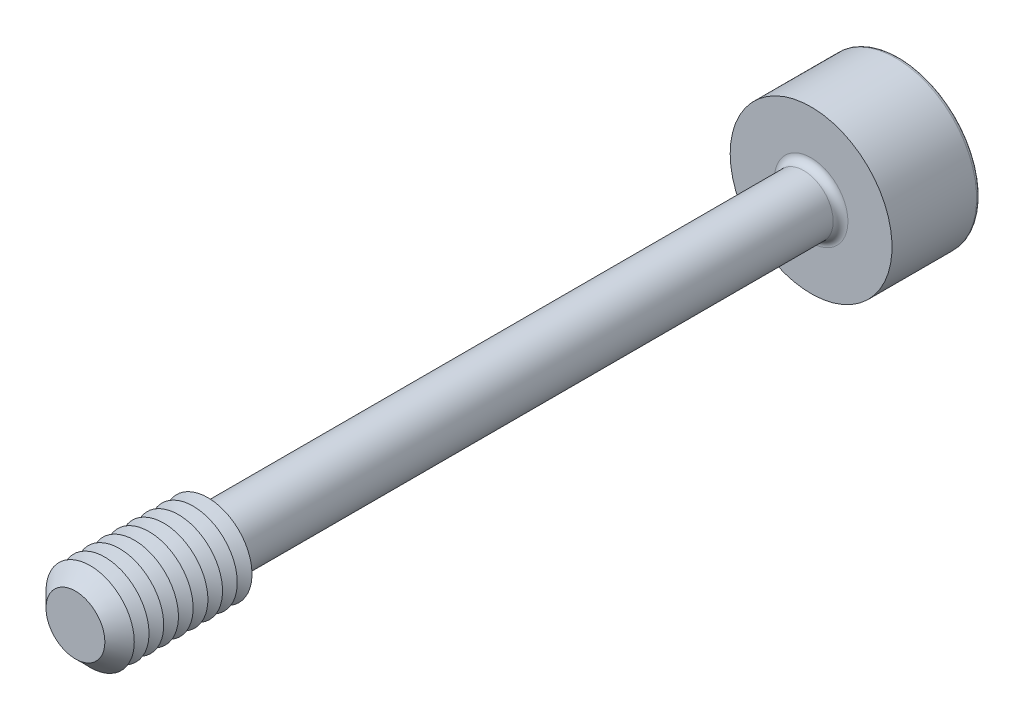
ISO-10303-21;
HEADER;
FILE_DESCRIPTION(('STEP AP214'),'2;1');
FILE_NAME('part.step','',(''),(''),'','','');
FILE_SCHEMA(('AUTOMOTIVE_DESIGN { 1 0 10303 214 1 1 1 1 }'));
ENDSEC;
DATA;
#1=APPLICATION_CONTEXT('core data for automotive mechanical design processes');
#2=APPLICATION_PROTOCOL_DEFINITION('international standard','automotive_design',2000,#1);
#3=PRODUCT_CONTEXT('',#1,'mechanical');
#4=PRODUCT('Part','Part','',(#3));
#5=PRODUCT_RELATED_PRODUCT_CATEGORY('part','',(#4));
#6=PRODUCT_DEFINITION_FORMATION('','',#4);
#7=PRODUCT_DEFINITION_CONTEXT('part definition',#1,'design');
#8=PRODUCT_DEFINITION('design','',#6,#7);
#9=PRODUCT_DEFINITION_SHAPE('','',#8);
#10=(LENGTH_UNIT() NAMED_UNIT(*) SI_UNIT(.MILLI.,.METRE.));
#11=(NAMED_UNIT(*) PLANE_ANGLE_UNIT() SI_UNIT($,.RADIAN.));
#12=(NAMED_UNIT(*) SI_UNIT($,.STERADIAN.) SOLID_ANGLE_UNIT());
#13=UNCERTAINTY_MEASURE_WITH_UNIT(LENGTH_MEASURE(1.E-05),#10,'distance_accuracy_value','');
#14=(GEOMETRIC_REPRESENTATION_CONTEXT(3) GLOBAL_UNCERTAINTY_ASSIGNED_CONTEXT((#13)) GLOBAL_UNIT_ASSIGNED_CONTEXT((#10,
#11,#12)) REPRESENTATION_CONTEXT('',''));
#15=CARTESIAN_POINT('',(0.,0.,0.));
#16=DIRECTION('',(0.,0.,1.));
#17=DIRECTION('',(1.,0.,0.));
#18=AXIS2_PLACEMENT_3D('',#15,#16,#17);
#19=CARTESIAN_POINT('',(-0.721687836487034,-1.25,-13.));
#20=DIRECTION('',(0.,0.,1.));
#21=DIRECTION('',(1.,0.,0.));
#22=AXIS2_PLACEMENT_3D('',#19,#20,#21);
#23=PLANE('',#22);
#24=DIRECTION('',(1.,0.,0.));
#25=VECTOR('',#24,1.);
#26=CARTESIAN_POINT('',(-0.721687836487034,-1.25,-13.));
#27=LINE('',#26,#25);
#28=CARTESIAN_POINT('',(0.,-1.25,-13.));
#29=VERTEX_POINT('',#28);
#30=CARTESIAN_POINT('',(0.721687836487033,-1.25,-13.));
#31=VERTEX_POINT('',#30);
#32=EDGE_CURVE('E410',#29,#31,#27,.T.);
#33=ORIENTED_EDGE('',*,*,#32,.F.);
#34=CARTESIAN_POINT('',(0.,0.,-13.));
#35=DIRECTION('',(0.,0.,1.));
#36=DIRECTION('',(0.,-1.,0.));
#37=AXIS2_PLACEMENT_3D('',#34,#35,#36);
#38=CIRCLE('',#37,1.25);
#39=CARTESIAN_POINT('',(1.08253175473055,-0.624999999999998,-13.));
#40=VERTEX_POINT('',#39);
#41=EDGE_CURVE('E53',#29,#40,#38,.T.);
#42=ORIENTED_EDGE('',*,*,#41,.T.);
#43=DIRECTION('',(0.499999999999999,0.866025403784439,0.));
#44=VECTOR('',#43,1.);
#45=CARTESIAN_POINT('',(0.721687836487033,-1.25,-13.));
#46=LINE('',#45,#44);
#47=EDGE_CURVE('E400',#31,#40,#46,.T.);
#48=ORIENTED_EDGE('',*,*,#47,.F.);
#49=EDGE_LOOP('',(#33,#42,#48));
#50=FACE_BOUND('',#49,.T.);
#51=ADVANCED_FACE('F41',(#50),#23,.F.);
#52=CARTESIAN_POINT('',(1.44337567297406,0.,-13.));
#53=VERTEX_POINT('',#52);
#54=EDGE_CURVE('E404',#40,#53,#46,.T.);
#55=ORIENTED_EDGE('',*,*,#54,.F.);
#56=CARTESIAN_POINT('',(1.08253175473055,0.625000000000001,-13.));
#57=VERTEX_POINT('',#56);
#58=EDGE_CURVE('E11',#40,#57,#38,.T.);
#59=ORIENTED_EDGE('',*,*,#58,.T.);
#60=DIRECTION('',(-0.499999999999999,0.866025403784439,0.));
#61=VECTOR('',#60,1.);
#62=CARTESIAN_POINT('',(1.44337567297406,0.,-13.));
#63=LINE('',#62,#61);
#64=EDGE_CURVE('E396',#53,#57,#63,.T.);
#65=ORIENTED_EDGE('',*,*,#64,.F.);
#66=EDGE_LOOP('',(#55,#59,#65));
#67=FACE_BOUND('',#66,.T.);
#68=ADVANCED_FACE('F133',(#67),#23,.F.);
#69=CARTESIAN_POINT('',(0.721687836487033,1.25,-13.));
#70=VERTEX_POINT('',#69);
#71=EDGE_CURVE('E395',#57,#70,#63,.T.);
#72=ORIENTED_EDGE('',*,*,#71,.F.);
#73=CARTESIAN_POINT('',(0.,1.25,-13.));
#74=VERTEX_POINT('',#73);
#75=EDGE_CURVE('E51',#57,#74,#38,.T.);
#76=ORIENTED_EDGE('',*,*,#75,.T.);
#77=DIRECTION('',(-1.,0.,0.));
#78=VECTOR('',#77,1.);
#79=CARTESIAN_POINT('',(0.721687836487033,1.25,-13.));
#80=LINE('',#79,#78);
#81=EDGE_CURVE('E177',#70,#74,#80,.T.);
#82=ORIENTED_EDGE('',*,*,#81,.F.);
#83=EDGE_LOOP('',(#72,#76,#82));
#84=FACE_BOUND('',#83,.T.);
#85=ADVANCED_FACE('F139',(#84),#23,.F.);
#86=CARTESIAN_POINT('',(-0.721687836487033,1.25,-13.));
#87=VERTEX_POINT('',#86);
#88=EDGE_CURVE('E401',#74,#87,#80,.T.);
#89=ORIENTED_EDGE('',*,*,#88,.F.);
#90=CARTESIAN_POINT('',(-1.08253175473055,0.625000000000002,-13.));
#91=VERTEX_POINT('',#90);
#92=EDGE_CURVE('E265',#74,#91,#38,.T.);
#93=ORIENTED_EDGE('',*,*,#92,.T.);
#94=DIRECTION('',(-0.5,-0.866025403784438,0.));
#95=VECTOR('',#94,1.);
#96=CARTESIAN_POINT('',(-0.721687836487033,1.25,-13.));
#97=LINE('',#96,#95);
#98=EDGE_CURVE('E176',#87,#91,#97,.T.);
#99=ORIENTED_EDGE('',*,*,#98,.F.);
#100=EDGE_LOOP('',(#89,#93,#99));
#101=FACE_BOUND('',#100,.T.);
#102=ADVANCED_FACE('F157',(#101),#23,.F.);
#103=CARTESIAN_POINT('',(-1.44337567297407,0.,-13.));
#104=VERTEX_POINT('',#103);
#105=EDGE_CURVE('E170',#91,#104,#97,.T.);
#106=ORIENTED_EDGE('',*,*,#105,.F.);
#107=CARTESIAN_POINT('',(-1.08253175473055,-0.624999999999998,-13.));
#108=VERTEX_POINT('',#107);
#109=EDGE_CURVE('E172',#91,#108,#38,.T.);
#110=ORIENTED_EDGE('',*,*,#109,.T.);
#111=DIRECTION('',(0.5,-0.866025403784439,0.));
#112=VECTOR('',#111,1.);
#113=CARTESIAN_POINT('',(-1.44337567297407,0.,-13.));
#114=LINE('',#113,#112);
#115=EDGE_CURVE('E174',#104,#108,#114,.T.);
#116=ORIENTED_EDGE('',*,*,#115,.F.);
#117=EDGE_LOOP('',(#106,#110,#116));
#118=FACE_BOUND('',#117,.T.);
#119=ADVANCED_FACE('F146',(#118),#23,.F.);
#120=CARTESIAN_POINT('',(0.,0.,-15.5));
#121=DIRECTION('',(0.,0.,-1.));
#122=DIRECTION('',(-1.,0.,0.));
#123=AXIS2_PLACEMENT_3D('',#120,#121,#122);
#124=PLANE('',#123);
#125=CARTESIAN_POINT('',(0.,0.,-15.5));
#126=DIRECTION('',(0.,0.,-1.));
#127=DIRECTION('',(-1.,0.,0.));
#128=AXIS2_PLACEMENT_3D('',#125,#126,#127);
#129=CIRCLE('',#128,2.625);
#130=CARTESIAN_POINT('',(-2.625,0.,-15.5));
#131=VERTEX_POINT('',#130);
#132=EDGE_CURVE('E249',#131,#131,#129,.T.);
#133=ORIENTED_EDGE('',*,*,#132,.T.);
#134=EDGE_LOOP('',(#133));
#135=FACE_BOUND('',#134,.T.);
#136=DIRECTION('',(-0.5,-0.866025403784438,0.));
#137=VECTOR('',#136,1.);
#138=CARTESIAN_POINT('',(-0.721687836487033,1.25,-15.5));
#139=LINE('',#138,#137);
#140=CARTESIAN_POINT('',(-0.721687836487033,1.25,-15.5));
#141=VERTEX_POINT('',#140);
#142=CARTESIAN_POINT('',(-1.44337567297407,0.,-15.5));
#143=VERTEX_POINT('',#142);
#144=EDGE_CURVE('E212',#141,#143,#139,.T.);
#145=ORIENTED_EDGE('',*,*,#144,.T.);
#146=DIRECTION('',(0.5,-0.866025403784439,0.));
#147=VECTOR('',#146,1.);
#148=CARTESIAN_POINT('',(-1.44337567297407,0.,-15.5));
#149=LINE('',#148,#147);
#150=CARTESIAN_POINT('',(-0.721687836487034,-1.25,-15.5));
#151=VERTEX_POINT('',#150);
#152=EDGE_CURVE('E67',#143,#151,#149,.T.);
#153=ORIENTED_EDGE('',*,*,#152,.T.);
#154=DIRECTION('',(1.,0.,0.));
#155=VECTOR('',#154,1.);
#156=CARTESIAN_POINT('',(-0.721687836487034,-1.25,-15.5));
#157=LINE('',#156,#155);
#158=CARTESIAN_POINT('',(0.721687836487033,-1.25,-15.5));
#159=VERTEX_POINT('',#158);
#160=EDGE_CURVE('E196',#151,#159,#157,.T.);
#161=ORIENTED_EDGE('',*,*,#160,.T.);
#162=DIRECTION('',(0.499999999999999,0.866025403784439,0.));
#163=VECTOR('',#162,1.);
#164=CARTESIAN_POINT('',(0.721687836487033,-1.25,-15.5));
#165=LINE('',#164,#163);
#166=CARTESIAN_POINT('',(1.44337567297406,0.,-15.5));
#167=VERTEX_POINT('',#166);
#168=EDGE_CURVE('E200',#159,#167,#165,.T.);
#169=ORIENTED_EDGE('',*,*,#168,.T.);
#170=DIRECTION('',(-0.499999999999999,0.866025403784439,0.));
#171=VECTOR('',#170,1.);
#172=CARTESIAN_POINT('',(1.44337567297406,0.,-15.5));
#173=LINE('',#172,#171);
#174=CARTESIAN_POINT('',(0.721687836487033,1.25,-15.5));
#175=VERTEX_POINT('',#174);
#176=EDGE_CURVE('E204',#167,#175,#173,.T.);
#177=ORIENTED_EDGE('',*,*,#176,.T.);
#178=DIRECTION('',(-1.,0.,0.));
#179=VECTOR('',#178,1.);
#180=CARTESIAN_POINT('',(0.721687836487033,1.25,-15.5));
#181=LINE('',#180,#179);
#182=EDGE_CURVE('E208',#175,#141,#181,.T.);
#183=ORIENTED_EDGE('',*,*,#182,.T.);
#184=EDGE_LOOP('',(#145,#153,#161,#169,#177,#183));
#185=FACE_BOUND('',#184,.T.);
#186=ADVANCED_FACE('F156',(#135,#185),#124,.T.);
#187=CARTESIAN_POINT('',(0.,0.,12.5));
#188=DIRECTION('',(0.,0.,-1.));
#189=DIRECTION('',(-1.,0.,0.));
#190=AXIS2_PLACEMENT_3D('',#187,#188,#189);
#191=CYLINDRICAL_SURFACE('',#190,1.);
#192=CARTESIAN_POINT('',(0.,0.,-12.25));
#193=DIRECTION('',(0.,0.,-1.));
#194=DIRECTION('',(-1.,0.,0.));
#195=AXIS2_PLACEMENT_3D('',#192,#193,#194);
#196=CIRCLE('',#195,1.);
#197=CARTESIAN_POINT('',(-1.,0.,-12.25));
#198=VERTEX_POINT('',#197);
#199=EDGE_CURVE('E246',#198,#198,#196,.F.);
#200=ORIENTED_EDGE('',*,*,#199,.T.);
#201=EDGE_LOOP('',(#200));
#202=FACE_BOUND('',#201,.T.);
#203=CARTESIAN_POINT('',(0.,0.,7.71132486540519));
#204=DIRECTION('',(0.,0.,-1.));
#205=DIRECTION('',(0.,1.,0.));
#206=AXIS2_PLACEMENT_3D('',#203,#204,#205);
#207=CIRCLE('',#206,1.);
#208=CARTESIAN_POINT('',(0.,1.,7.71132486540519));
#209=VERTEX_POINT('',#208);
#210=EDGE_CURVE('E234',#209,#209,#207,.T.);
#211=ORIENTED_EDGE('',*,*,#210,.T.);
#212=EDGE_LOOP('',(#211));
#213=FACE_BOUND('',#212,.T.);
#214=ADVANCED_FACE('F163',(#202,#213),#191,.T.);
#215=CARTESIAN_POINT('',(0.,0.,7.71132486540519));
#216=DIRECTION('',(0.,0.,1.));
#217=DIRECTION('',(0.,-1.,0.));
#218=AXIS2_PLACEMENT_3D('',#215,#216,#217);
#219=CONICAL_SURFACE('',#218,1.,1.0471975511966);
#220=CARTESIAN_POINT('',(0.,0.,8.));
#221=DIRECTION('',(0.,0.,-1.));
#222=DIRECTION('',(-1.,0.,0.));
#223=AXIS2_PLACEMENT_3D('',#220,#221,#222);
#224=CIRCLE('',#223,1.5);
#225=CARTESIAN_POINT('',(-1.5,0.,8.));
#226=VERTEX_POINT('',#225);
#227=EDGE_CURVE('E269',#226,#226,#224,.T.);
#228=ORIENTED_EDGE('',*,*,#227,.T.);
#229=EDGE_LOOP('',(#228));
#230=FACE_BOUND('',#229,.T.);
#231=ORIENTED_EDGE('',*,*,#210,.F.);
#232=EDGE_LOOP('',(#231));
#233=FACE_BOUND('',#232,.T.);
#234=ADVANCED_FACE('F353',(#230,#233),#219,.T.);
#235=CARTESIAN_POINT('',(0.,0.,-12.5));
#236=DIRECTION('',(0.,0.,-1.));
#237=DIRECTION('',(-1.,0.,0.));
#238=AXIS2_PLACEMENT_3D('',#235,#236,#237);
#239=PLANE('',#238);
#240=CARTESIAN_POINT('',(0.,0.,-12.5));
#241=DIRECTION('',(0.,0.,-1.));
#242=DIRECTION('',(-1.,0.,0.));
#243=AXIS2_PLACEMENT_3D('',#240,#241,#242);
#244=CIRCLE('',#243,1.25);
#245=CARTESIAN_POINT('',(-1.25,0.,-12.5));
#246=VERTEX_POINT('',#245);
#247=EDGE_CURVE('E242',#246,#246,#244,.T.);
#248=ORIENTED_EDGE('',*,*,#247,.T.);
#249=EDGE_LOOP('',(#248));
#250=FACE_BOUND('',#249,.T.);
#251=CARTESIAN_POINT('',(0.,0.,-12.5));
#252=DIRECTION('',(0.,0.,-1.));
#253=DIRECTION('',(-1.,0.,0.));
#254=AXIS2_PLACEMENT_3D('',#251,#252,#253);
#255=CIRCLE('',#254,2.75);
#256=CARTESIAN_POINT('',(-2.75,0.,-12.5));
#257=VERTEX_POINT('',#256);
#258=EDGE_CURVE('E230',#257,#257,#255,.T.);
#259=ORIENTED_EDGE('',*,*,#258,.F.);
#260=EDGE_LOOP('',(#259));
#261=FACE_BOUND('',#260,.T.);
#262=ADVANCED_FACE('F358',(#250,#261),#239,.F.);
#263=CARTESIAN_POINT('',(0.,0.,-15.5));
#264=DIRECTION('',(0.,0.,1.));
#265=DIRECTION('',(1.,0.,0.));
#266=AXIS2_PLACEMENT_3D('',#263,#264,#265);
#267=CYLINDRICAL_SURFACE('',#266,2.75);
#268=CARTESIAN_POINT('',(0.,0.,-15.375));
#269=DIRECTION('',(0.,0.,-1.));
#270=DIRECTION('',(-1.,0.,0.));
#271=AXIS2_PLACEMENT_3D('',#268,#269,#270);
#272=CIRCLE('',#271,2.75);
#273=CARTESIAN_POINT('',(-2.75,0.,-15.375));
#274=VERTEX_POINT('',#273);
#275=EDGE_CURVE('E45',#274,#274,#272,.F.);
#276=ORIENTED_EDGE('',*,*,#275,.T.);
#277=EDGE_LOOP('',(#276));
#278=FACE_BOUND('',#277,.T.);
#279=ORIENTED_EDGE('',*,*,#258,.T.);
#280=EDGE_LOOP('',(#279));
#281=FACE_BOUND('',#280,.T.);
#282=ADVANCED_FACE('F359',(#278,#281),#267,.T.);
#283=CARTESIAN_POINT('',(-1.44337567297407,0.,-13.));
#284=DIRECTION('',(0.866025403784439,0.5,0.));
#285=DIRECTION('',(-0.5,0.866025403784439,0.));
#286=AXIS2_PLACEMENT_3D('',#283,#284,#285);
#287=PLANE('',#286);
#288=ORIENTED_EDGE('',*,*,#152,.F.);
#289=DIRECTION('',(0.,0.,-1.));
#290=VECTOR('',#289,1.);
#291=CARTESIAN_POINT('',(-1.44337567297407,0.,-13.));
#292=LINE('',#291,#290);
#293=EDGE_CURVE('E186',#104,#143,#292,.T.);
#294=ORIENTED_EDGE('',*,*,#293,.F.);
#295=ORIENTED_EDGE('',*,*,#115,.T.);
#296=CARTESIAN_POINT('',(-0.721687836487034,-1.25,-13.));
#297=VERTEX_POINT('',#296);
#298=EDGE_CURVE('E215',#108,#297,#114,.T.);
#299=ORIENTED_EDGE('',*,*,#298,.T.);
#300=DIRECTION('',(0.,0.,-1.));
#301=VECTOR('',#300,1.);
#302=CARTESIAN_POINT('',(-0.721687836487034,-1.25,-13.));
#303=LINE('',#302,#301);
#304=EDGE_CURVE('E227',#297,#151,#303,.T.);
#305=ORIENTED_EDGE('',*,*,#304,.T.);
#306=EDGE_LOOP('',(#288,#294,#295,#299,#305));
#307=FACE_BOUND('',#306,.T.);
#308=ADVANCED_FACE('F362',(#307),#287,.T.);
#309=CARTESIAN_POINT('',(-0.721687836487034,-1.25,-13.));
#310=DIRECTION('',(0.,1.,0.));
#311=DIRECTION('',(0.,0.,1.));
#312=AXIS2_PLACEMENT_3D('',#309,#310,#311);
#313=PLANE('',#312);
#314=ORIENTED_EDGE('',*,*,#160,.F.);
#315=ORIENTED_EDGE('',*,*,#304,.F.);
#316=EDGE_CURVE('E407',#297,#29,#27,.T.);
#317=ORIENTED_EDGE('',*,*,#316,.T.);
#318=ORIENTED_EDGE('',*,*,#32,.T.);
#319=DIRECTION('',(0.,0.,-1.));
#320=VECTOR('',#319,1.);
#321=CARTESIAN_POINT('',(0.721687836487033,-1.25,-13.));
#322=LINE('',#321,#320);
#323=EDGE_CURVE('E224',#31,#159,#322,.T.);
#324=ORIENTED_EDGE('',*,*,#323,.T.);
#325=EDGE_LOOP('',(#314,#315,#317,#318,#324));
#326=FACE_BOUND('',#325,.T.);
#327=ADVANCED_FACE('F368',(#326),#313,.T.);
#328=CARTESIAN_POINT('',(0.721687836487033,-1.25,-13.));
#329=DIRECTION('',(-0.866025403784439,0.499999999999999,0.));
#330=DIRECTION('',(-0.499999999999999,-0.866025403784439,0.));
#331=AXIS2_PLACEMENT_3D('',#328,#329,#330);
#332=PLANE('',#331);
#333=ORIENTED_EDGE('',*,*,#168,.F.);
#334=ORIENTED_EDGE('',*,*,#323,.F.);
#335=ORIENTED_EDGE('',*,*,#47,.T.);
#336=ORIENTED_EDGE('',*,*,#54,.T.);
#337=DIRECTION('',(0.,0.,-1.));
#338=VECTOR('',#337,1.);
#339=CARTESIAN_POINT('',(1.44337567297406,0.,-13.));
#340=LINE('',#339,#338);
#341=EDGE_CURVE('E221',#53,#167,#340,.T.);
#342=ORIENTED_EDGE('',*,*,#341,.T.);
#343=EDGE_LOOP('',(#333,#334,#335,#336,#342));
#344=FACE_BOUND('',#343,.T.);
#345=ADVANCED_FACE('F371',(#344),#332,.T.);
#346=CARTESIAN_POINT('',(1.44337567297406,0.,-13.));
#347=DIRECTION('',(-0.866025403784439,-0.5,0.));
#348=DIRECTION('',(0.5,-0.866025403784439,0.));
#349=AXIS2_PLACEMENT_3D('',#346,#347,#348);
#350=PLANE('',#349);
#351=ORIENTED_EDGE('',*,*,#176,.F.);
#352=ORIENTED_EDGE('',*,*,#341,.F.);
#353=ORIENTED_EDGE('',*,*,#64,.T.);
#354=ORIENTED_EDGE('',*,*,#71,.T.);
#355=DIRECTION('',(0.,0.,-1.));
#356=VECTOR('',#355,1.);
#357=CARTESIAN_POINT('',(0.721687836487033,1.25,-13.));
#358=LINE('',#357,#356);
#359=EDGE_CURVE('E219',#70,#175,#358,.T.);
#360=ORIENTED_EDGE('',*,*,#359,.T.);
#361=EDGE_LOOP('',(#351,#352,#353,#354,#360));
#362=FACE_BOUND('',#361,.T.);
#363=ADVANCED_FACE('F375',(#362),#350,.T.);
#364=CARTESIAN_POINT('',(0.721687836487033,1.25,-13.));
#365=DIRECTION('',(0.,-1.,0.));
#366=DIRECTION('',(1.,0.,0.));
#367=AXIS2_PLACEMENT_3D('',#364,#365,#366);
#368=PLANE('',#367);
#369=ORIENTED_EDGE('',*,*,#182,.F.);
#370=ORIENTED_EDGE('',*,*,#359,.F.);
#371=ORIENTED_EDGE('',*,*,#81,.T.);
#372=ORIENTED_EDGE('',*,*,#88,.T.);
#373=DIRECTION('',(0.,0.,-1.));
#374=VECTOR('',#373,1.);
#375=CARTESIAN_POINT('',(-0.721687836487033,1.25,-13.));
#376=LINE('',#375,#374);
#377=EDGE_CURVE('E182',#87,#141,#376,.T.);
#378=ORIENTED_EDGE('',*,*,#377,.T.);
#379=EDGE_LOOP('',(#369,#370,#371,#372,#378));
#380=FACE_BOUND('',#379,.T.);
#381=ADVANCED_FACE('F152',(#380),#368,.T.);
#382=CARTESIAN_POINT('',(-0.721687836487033,1.25,-13.));
#383=DIRECTION('',(0.866025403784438,-0.5,0.));
#384=DIRECTION('',(0.5,0.866025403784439,0.));
#385=AXIS2_PLACEMENT_3D('',#382,#383,#384);
#386=PLANE('',#385);
#387=ORIENTED_EDGE('',*,*,#144,.F.);
#388=ORIENTED_EDGE('',*,*,#377,.F.);
#389=ORIENTED_EDGE('',*,*,#98,.T.);
#390=ORIENTED_EDGE('',*,*,#105,.T.);
#391=ORIENTED_EDGE('',*,*,#293,.T.);
#392=EDGE_LOOP('',(#387,#388,#389,#390,#391));
#393=FACE_BOUND('',#392,.T.);
#394=ADVANCED_FACE('F144',(#393),#386,.T.);
#395=ORIENTED_EDGE('',*,*,#298,.F.);
#396=EDGE_CURVE('E256',#108,#29,#38,.T.);
#397=ORIENTED_EDGE('',*,*,#396,.T.);
#398=ORIENTED_EDGE('',*,*,#316,.F.);
#399=EDGE_LOOP('',(#395,#397,#398));
#400=FACE_BOUND('',#399,.T.);
#401=ADVANCED_FACE('F135',(#400),#23,.F.);
#402=CARTESIAN_POINT('',(0.,0.,-12.25));
#403=DIRECTION('',(0.,0.,-1.));
#404=DIRECTION('',(-1.,0.,0.));
#405=AXIS2_PLACEMENT_3D('',#402,#403,#404);
#406=TOROIDAL_SURFACE('',#405,1.25,0.25);
#407=ORIENTED_EDGE('',*,*,#199,.F.);
#408=EDGE_LOOP('',(#407));
#409=FACE_BOUND('',#408,.T.);
#410=ORIENTED_EDGE('',*,*,#247,.F.);
#411=EDGE_LOOP('',(#410));
#412=FACE_BOUND('',#411,.T.);
#413=ADVANCED_FACE('F129',(#409,#412),#406,.F.);
#414=CARTESIAN_POINT('',(0.,0.,-15.375));
#415=DIRECTION('',(0.,0.,-1.));
#416=DIRECTION('',(-1.,0.,0.));
#417=AXIS2_PLACEMENT_3D('',#414,#415,#416);
#418=TOROIDAL_SURFACE('',#417,2.625,0.125);
#419=ORIENTED_EDGE('',*,*,#275,.F.);
#420=EDGE_LOOP('',(#419));
#421=FACE_BOUND('',#420,.T.);
#422=ORIENTED_EDGE('',*,*,#132,.F.);
#423=EDGE_LOOP('',(#422));
#424=FACE_BOUND('',#423,.T.);
#425=ADVANCED_FACE('F43',(#421,#424),#418,.T.);
#426=CARTESIAN_POINT('',(0.,0.,-12.278312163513));
#427=DIRECTION('',(0.,0.,-1.));
#428=DIRECTION('',(0.,1.,0.));
#429=AXIS2_PLACEMENT_3D('',#426,#427,#428);
#430=CONICAL_SURFACE('',#429,0.,1.0471975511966);
#431=ORIENTED_EDGE('',*,*,#41,.F.);
#432=ORIENTED_EDGE('',*,*,#396,.F.);
#433=ORIENTED_EDGE('',*,*,#109,.F.);
#434=ORIENTED_EDGE('',*,*,#92,.F.);
#435=ORIENTED_EDGE('',*,*,#75,.F.);
#436=ORIENTED_EDGE('',*,*,#58,.F.);
#437=EDGE_LOOP('',(#431,#432,#433,#434,#435,#436));
#438=FACE_BOUND('',#437,.T.);
#439=CARTESIAN_POINT('',(0.,0.,-12.278312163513));
#440=VERTEX_POINT('',#439);
#441=VERTEX_LOOP('',#440);
#442=FACE_BOUND('',#441,.T.);
#443=ADVANCED_FACE('F118',(#438,#442),#430,.F.);
#444=CARTESIAN_POINT('',(0.,0.,8.25));
#445=DIRECTION('',(0.,0.,-1.));
#446=DIRECTION('',(-1.,0.,0.));
#447=AXIS2_PLACEMENT_3D('',#444,#445,#446);
#448=CONICAL_SURFACE('',#447,1.06698729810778,1.0471975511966);
#449=ORIENTED_EDGE('',*,*,#227,.F.);
#450=EDGE_LOOP('',(#449));
#451=FACE_BOUND('',#450,.T.);
#452=CARTESIAN_POINT('',(0.,0.,8.25));
#453=DIRECTION('',(0.,0.,-1.));
#454=DIRECTION('',(-1.,0.,0.));
#455=AXIS2_PLACEMENT_3D('',#452,#453,#454);
#456=CIRCLE('',#455,1.06698729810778);
#457=CARTESIAN_POINT('',(-1.06698729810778,0.,8.25));
#458=VERTEX_POINT('',#457);
#459=EDGE_CURVE('E275',#458,#458,#456,.T.);
#460=ORIENTED_EDGE('',*,*,#459,.T.);
#461=EDGE_LOOP('',(#460));
#462=FACE_BOUND('',#461,.T.);
#463=ADVANCED_FACE('F120',(#451,#462),#448,.T.);
#464=CARTESIAN_POINT('',(0.,0.,8.5));
#465=DIRECTION('',(0.,0.,1.));
#466=DIRECTION('',(1.,0.,0.));
#467=AXIS2_PLACEMENT_3D('',#464,#465,#466);
#468=CONICAL_SURFACE('',#467,1.5,1.0471975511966);
#469=ORIENTED_EDGE('',*,*,#459,.F.);
#470=EDGE_LOOP('',(#469));
#471=FACE_BOUND('',#470,.T.);
#472=CARTESIAN_POINT('',(0.,0.,8.5));
#473=DIRECTION('',(0.,0.,-1.));
#474=DIRECTION('',(-1.,0.,0.));
#475=AXIS2_PLACEMENT_3D('',#472,#473,#474);
#476=CIRCLE('',#475,1.5);
#477=CARTESIAN_POINT('',(-1.5,0.,8.5));
#478=VERTEX_POINT('',#477);
#479=EDGE_CURVE('E280',#478,#478,#476,.T.);
#480=ORIENTED_EDGE('',*,*,#479,.T.);
#481=EDGE_LOOP('',(#480));
#482=FACE_BOUND('',#481,.T.);
#483=ADVANCED_FACE('F126',(#471,#482),#468,.T.);
#484=CARTESIAN_POINT('',(0.,0.,8.75));
#485=DIRECTION('',(0.,0.,-1.));
#486=DIRECTION('',(-1.,0.,0.));
#487=AXIS2_PLACEMENT_3D('',#484,#485,#486);
#488=CONICAL_SURFACE('',#487,1.06698729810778,1.0471975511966);
#489=ORIENTED_EDGE('',*,*,#479,.F.);
#490=EDGE_LOOP('',(#489));
#491=FACE_BOUND('',#490,.T.);
#492=CARTESIAN_POINT('',(0.,0.,8.75));
#493=DIRECTION('',(0.,0.,-1.));
#494=DIRECTION('',(-1.,0.,0.));
#495=AXIS2_PLACEMENT_3D('',#492,#493,#494);
#496=CIRCLE('',#495,1.06698729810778);
#497=CARTESIAN_POINT('',(-1.06698729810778,0.,8.75));
#498=VERTEX_POINT('',#497);
#499=EDGE_CURVE('E286',#498,#498,#496,.T.);
#500=ORIENTED_EDGE('',*,*,#499,.T.);
#501=EDGE_LOOP('',(#500));
#502=FACE_BOUND('',#501,.T.);
#503=ADVANCED_FACE('F516',(#491,#502),#488,.T.);
#504=CARTESIAN_POINT('',(0.,0.,9.));
#505=DIRECTION('',(0.,0.,1.));
#506=DIRECTION('',(1.,0.,0.));
#507=AXIS2_PLACEMENT_3D('',#504,#505,#506);
#508=CONICAL_SURFACE('',#507,1.5,1.0471975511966);
#509=ORIENTED_EDGE('',*,*,#499,.F.);
#510=EDGE_LOOP('',(#509));
#511=FACE_BOUND('',#510,.T.);
#512=CARTESIAN_POINT('',(0.,0.,9.));
#513=DIRECTION('',(0.,0.,-1.));
#514=DIRECTION('',(-1.,0.,0.));
#515=AXIS2_PLACEMENT_3D('',#512,#513,#514);
#516=CIRCLE('',#515,1.5);
#517=CARTESIAN_POINT('',(-1.5,0.,9.));
#518=VERTEX_POINT('',#517);
#519=EDGE_CURVE('E289',#518,#518,#516,.T.);
#520=ORIENTED_EDGE('',*,*,#519,.T.);
#521=EDGE_LOOP('',(#520));
#522=FACE_BOUND('',#521,.T.);
#523=ADVANCED_FACE('F525',(#511,#522),#508,.T.);
#524=CARTESIAN_POINT('',(0.,0.,9.25));
#525=DIRECTION('',(0.,0.,-1.));
#526=DIRECTION('',(-1.,0.,0.));
#527=AXIS2_PLACEMENT_3D('',#524,#525,#526);
#528=CONICAL_SURFACE('',#527,1.06698729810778,1.0471975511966);
#529=ORIENTED_EDGE('',*,*,#519,.F.);
#530=EDGE_LOOP('',(#529));
#531=FACE_BOUND('',#530,.T.);
#532=CARTESIAN_POINT('',(0.,0.,9.25));
#533=DIRECTION('',(0.,0.,-1.));
#534=DIRECTION('',(-1.,0.,0.));
#535=AXIS2_PLACEMENT_3D('',#532,#533,#534);
#536=CIRCLE('',#535,1.06698729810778);
#537=CARTESIAN_POINT('',(-1.06698729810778,0.,9.25));
#538=VERTEX_POINT('',#537);
#539=EDGE_CURVE('E293',#538,#538,#536,.T.);
#540=ORIENTED_EDGE('',*,*,#539,.T.);
#541=EDGE_LOOP('',(#540));
#542=FACE_BOUND('',#541,.T.);
#543=ADVANCED_FACE('F534',(#531,#542),#528,.T.);
#544=CARTESIAN_POINT('',(0.,0.,9.5));
#545=DIRECTION('',(0.,0.,1.));
#546=DIRECTION('',(1.,0.,0.));
#547=AXIS2_PLACEMENT_3D('',#544,#545,#546);
#548=CONICAL_SURFACE('',#547,1.5,1.0471975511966);
#549=ORIENTED_EDGE('',*,*,#539,.F.);
#550=EDGE_LOOP('',(#549));
#551=FACE_BOUND('',#550,.T.);
#552=CARTESIAN_POINT('',(0.,0.,9.5));
#553=DIRECTION('',(0.,0.,-1.));
#554=DIRECTION('',(-1.,0.,0.));
#555=AXIS2_PLACEMENT_3D('',#552,#553,#554);
#556=CIRCLE('',#555,1.5);
#557=CARTESIAN_POINT('',(-1.5,0.,9.5));
#558=VERTEX_POINT('',#557);
#559=EDGE_CURVE('E297',#558,#558,#556,.T.);
#560=ORIENTED_EDGE('',*,*,#559,.T.);
#561=EDGE_LOOP('',(#560));
#562=FACE_BOUND('',#561,.T.);
#563=ADVANCED_FACE('F543',(#551,#562),#548,.T.);
#564=CARTESIAN_POINT('',(0.,0.,9.75));
#565=DIRECTION('',(0.,0.,-1.));
#566=DIRECTION('',(-1.,0.,0.));
#567=AXIS2_PLACEMENT_3D('',#564,#565,#566);
#568=CONICAL_SURFACE('',#567,1.06698729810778,1.0471975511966);
#569=ORIENTED_EDGE('',*,*,#559,.F.);
#570=EDGE_LOOP('',(#569));
#571=FACE_BOUND('',#570,.T.);
#572=CARTESIAN_POINT('',(0.,0.,9.75));
#573=DIRECTION('',(0.,0.,-1.));
#574=DIRECTION('',(-1.,0.,0.));
#575=AXIS2_PLACEMENT_3D('',#572,#573,#574);
#576=CIRCLE('',#575,1.06698729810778);
#577=CARTESIAN_POINT('',(-1.06698729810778,0.,9.75));
#578=VERTEX_POINT('',#577);
#579=EDGE_CURVE('E301',#578,#578,#576,.T.);
#580=ORIENTED_EDGE('',*,*,#579,.T.);
#581=EDGE_LOOP('',(#580));
#582=FACE_BOUND('',#581,.T.);
#583=ADVANCED_FACE('F552',(#571,#582),#568,.T.);
#584=CARTESIAN_POINT('',(0.,0.,10.));
#585=DIRECTION('',(0.,0.,1.));
#586=DIRECTION('',(1.,0.,0.));
#587=AXIS2_PLACEMENT_3D('',#584,#585,#586);
#588=CONICAL_SURFACE('',#587,1.5,1.0471975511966);
#589=ORIENTED_EDGE('',*,*,#579,.F.);
#590=EDGE_LOOP('',(#589));
#591=FACE_BOUND('',#590,.T.);
#592=CARTESIAN_POINT('',(0.,0.,10.));
#593=DIRECTION('',(0.,0.,-1.));
#594=DIRECTION('',(-1.,0.,0.));
#595=AXIS2_PLACEMENT_3D('',#592,#593,#594);
#596=CIRCLE('',#595,1.5);
#597=CARTESIAN_POINT('',(-1.5,0.,10.));
#598=VERTEX_POINT('',#597);
#599=EDGE_CURVE('E305',#598,#598,#596,.T.);
#600=ORIENTED_EDGE('',*,*,#599,.T.);
#601=EDGE_LOOP('',(#600));
#602=FACE_BOUND('',#601,.T.);
#603=ADVANCED_FACE('F561',(#591,#602),#588,.T.);
#604=CARTESIAN_POINT('',(0.,0.,10.25));
#605=DIRECTION('',(0.,0.,-1.));
#606=DIRECTION('',(-1.,0.,0.));
#607=AXIS2_PLACEMENT_3D('',#604,#605,#606);
#608=CONICAL_SURFACE('',#607,1.06698729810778,1.0471975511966);
#609=ORIENTED_EDGE('',*,*,#599,.F.);
#610=EDGE_LOOP('',(#609));
#611=FACE_BOUND('',#610,.T.);
#612=CARTESIAN_POINT('',(0.,0.,10.25));
#613=DIRECTION('',(0.,0.,-1.));
#614=DIRECTION('',(-1.,0.,0.));
#615=AXIS2_PLACEMENT_3D('',#612,#613,#614);
#616=CIRCLE('',#615,1.06698729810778);
#617=CARTESIAN_POINT('',(-1.06698729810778,0.,10.25));
#618=VERTEX_POINT('',#617);
#619=EDGE_CURVE('E308',#618,#618,#616,.T.);
#620=ORIENTED_EDGE('',*,*,#619,.T.);
#621=EDGE_LOOP('',(#620));
#622=FACE_BOUND('',#621,.T.);
#623=ADVANCED_FACE('F570',(#611,#622),#608,.T.);
#624=CARTESIAN_POINT('',(0.,0.,10.5));
#625=DIRECTION('',(0.,0.,1.));
#626=DIRECTION('',(1.,0.,0.));
#627=AXIS2_PLACEMENT_3D('',#624,#625,#626);
#628=CONICAL_SURFACE('',#627,1.5,1.0471975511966);
#629=ORIENTED_EDGE('',*,*,#619,.F.);
#630=EDGE_LOOP('',(#629));
#631=FACE_BOUND('',#630,.T.);
#632=CARTESIAN_POINT('',(0.,0.,10.5));
#633=DIRECTION('',(0.,0.,-1.));
#634=DIRECTION('',(-1.,0.,0.));
#635=AXIS2_PLACEMENT_3D('',#632,#633,#634);
#636=CIRCLE('',#635,1.5);
#637=CARTESIAN_POINT('',(-1.5,0.,10.5));
#638=VERTEX_POINT('',#637);
#639=EDGE_CURVE('E311',#638,#638,#636,.T.);
#640=ORIENTED_EDGE('',*,*,#639,.T.);
#641=EDGE_LOOP('',(#640));
#642=FACE_BOUND('',#641,.T.);
#643=ADVANCED_FACE('F579',(#631,#642),#628,.T.);
#644=CARTESIAN_POINT('',(0.,0.,10.75));
#645=DIRECTION('',(0.,0.,-1.));
#646=DIRECTION('',(-1.,0.,0.));
#647=AXIS2_PLACEMENT_3D('',#644,#645,#646);
#648=CONICAL_SURFACE('',#647,1.06698729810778,1.0471975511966);
#649=ORIENTED_EDGE('',*,*,#639,.F.);
#650=EDGE_LOOP('',(#649));
#651=FACE_BOUND('',#650,.T.);
#652=CARTESIAN_POINT('',(0.,0.,10.75));
#653=DIRECTION('',(0.,0.,-1.));
#654=DIRECTION('',(-1.,0.,0.));
#655=AXIS2_PLACEMENT_3D('',#652,#653,#654);
#656=CIRCLE('',#655,1.06698729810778);
#657=CARTESIAN_POINT('',(-1.06698729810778,0.,10.75));
#658=VERTEX_POINT('',#657);
#659=EDGE_CURVE('E315',#658,#658,#656,.T.);
#660=ORIENTED_EDGE('',*,*,#659,.T.);
#661=EDGE_LOOP('',(#660));
#662=FACE_BOUND('',#661,.T.);
#663=ADVANCED_FACE('F588',(#651,#662),#648,.T.);
#664=CARTESIAN_POINT('',(0.,0.,11.));
#665=DIRECTION('',(0.,0.,1.));
#666=DIRECTION('',(1.,0.,0.));
#667=AXIS2_PLACEMENT_3D('',#664,#665,#666);
#668=CONICAL_SURFACE('',#667,1.5,1.0471975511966);
#669=ORIENTED_EDGE('',*,*,#659,.F.);
#670=EDGE_LOOP('',(#669));
#671=FACE_BOUND('',#670,.T.);
#672=CARTESIAN_POINT('',(0.,0.,11.));
#673=DIRECTION('',(0.,0.,-1.));
#674=DIRECTION('',(-1.,0.,0.));
#675=AXIS2_PLACEMENT_3D('',#672,#673,#674);
#676=CIRCLE('',#675,1.5);
#677=CARTESIAN_POINT('',(-1.5,0.,11.));
#678=VERTEX_POINT('',#677);
#679=EDGE_CURVE('E319',#678,#678,#676,.T.);
#680=ORIENTED_EDGE('',*,*,#679,.T.);
#681=EDGE_LOOP('',(#680));
#682=FACE_BOUND('',#681,.T.);
#683=ADVANCED_FACE('F597',(#671,#682),#668,.T.);
#684=CARTESIAN_POINT('',(0.,0.,11.25));
#685=DIRECTION('',(0.,0.,-1.));
#686=DIRECTION('',(-1.,0.,0.));
#687=AXIS2_PLACEMENT_3D('',#684,#685,#686);
#688=CONICAL_SURFACE('',#687,1.06698729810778,1.0471975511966);
#689=ORIENTED_EDGE('',*,*,#679,.F.);
#690=EDGE_LOOP('',(#689));
#691=FACE_BOUND('',#690,.T.);
#692=CARTESIAN_POINT('',(0.,0.,11.25));
#693=DIRECTION('',(0.,0.,-1.));
#694=DIRECTION('',(-1.,0.,0.));
#695=AXIS2_PLACEMENT_3D('',#692,#693,#694);
#696=CIRCLE('',#695,1.06698729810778);
#697=CARTESIAN_POINT('',(-1.06698729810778,0.,11.25));
#698=VERTEX_POINT('',#697);
#699=EDGE_CURVE('E323',#698,#698,#696,.T.);
#700=ORIENTED_EDGE('',*,*,#699,.T.);
#701=EDGE_LOOP('',(#700));
#702=FACE_BOUND('',#701,.T.);
#703=ADVANCED_FACE('F606',(#691,#702),#688,.T.);
#704=CARTESIAN_POINT('',(0.,0.,11.5));
#705=DIRECTION('',(0.,0.,1.));
#706=DIRECTION('',(1.,0.,0.));
#707=AXIS2_PLACEMENT_3D('',#704,#705,#706);
#708=CONICAL_SURFACE('',#707,1.5,1.0471975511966);
#709=ORIENTED_EDGE('',*,*,#699,.F.);
#710=EDGE_LOOP('',(#709));
#711=FACE_BOUND('',#710,.T.);
#712=CARTESIAN_POINT('',(0.,0.,11.5));
#713=DIRECTION('',(0.,0.,-1.));
#714=DIRECTION('',(-1.,0.,0.));
#715=AXIS2_PLACEMENT_3D('',#712,#713,#714);
#716=CIRCLE('',#715,1.5);
#717=CARTESIAN_POINT('',(-1.5,0.,11.5));
#718=VERTEX_POINT('',#717);
#719=EDGE_CURVE('E326',#718,#718,#716,.T.);
#720=ORIENTED_EDGE('',*,*,#719,.T.);
#721=EDGE_LOOP('',(#720));
#722=FACE_BOUND('',#721,.T.);
#723=ADVANCED_FACE('F615',(#711,#722),#708,.T.);
#724=CARTESIAN_POINT('',(0.,0.,11.75));
#725=DIRECTION('',(0.,0.,-1.));
#726=DIRECTION('',(-1.,0.,0.));
#727=AXIS2_PLACEMENT_3D('',#724,#725,#726);
#728=CONICAL_SURFACE('',#727,1.06698729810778,1.0471975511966);
#729=ORIENTED_EDGE('',*,*,#719,.F.);
#730=EDGE_LOOP('',(#729));
#731=FACE_BOUND('',#730,.T.);
#732=CARTESIAN_POINT('',(0.,0.,11.75));
#733=DIRECTION('',(0.,0.,-1.));
#734=DIRECTION('',(-1.,0.,0.));
#735=AXIS2_PLACEMENT_3D('',#732,#733,#734);
#736=CIRCLE('',#735,1.06698729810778);
#737=CARTESIAN_POINT('',(-1.06698729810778,0.,11.75));
#738=VERTEX_POINT('',#737);
#739=EDGE_CURVE('E330',#738,#738,#736,.T.);
#740=ORIENTED_EDGE('',*,*,#739,.T.);
#741=EDGE_LOOP('',(#740));
#742=FACE_BOUND('',#741,.T.);
#743=ADVANCED_FACE('F624',(#731,#742),#728,.T.);
#744=CARTESIAN_POINT('',(0.,0.,12.));
#745=DIRECTION('',(0.,0.,1.));
#746=DIRECTION('',(1.,0.,0.));
#747=AXIS2_PLACEMENT_3D('',#744,#745,#746);
#748=CONICAL_SURFACE('',#747,1.5,1.0471975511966);
#749=ORIENTED_EDGE('',*,*,#739,.F.);
#750=EDGE_LOOP('',(#749));
#751=FACE_BOUND('',#750,.T.);
#752=CARTESIAN_POINT('',(0.,0.,12.));
#753=DIRECTION('',(0.,0.,-1.));
#754=DIRECTION('',(-1.,0.,0.));
#755=AXIS2_PLACEMENT_3D('',#752,#753,#754);
#756=CIRCLE('',#755,1.5);
#757=CARTESIAN_POINT('',(-1.5,0.,12.));
#758=VERTEX_POINT('',#757);
#759=EDGE_CURVE('E333',#758,#758,#756,.T.);
#760=ORIENTED_EDGE('',*,*,#759,.T.);
#761=EDGE_LOOP('',(#760));
#762=FACE_BOUND('',#761,.T.);
#763=ADVANCED_FACE('F338',(#751,#762),#748,.T.);
#764=CARTESIAN_POINT('',(0.,0.,12.5));
#765=DIRECTION('',(0.,0.,1.));
#766=DIRECTION('',(1.,0.,0.));
#767=AXIS2_PLACEMENT_3D('',#764,#765,#766);
#768=PLANE('',#767);
#769=CARTESIAN_POINT('',(0.,0.,12.5));
#770=DIRECTION('',(0.,0.,1.));
#771=DIRECTION('',(1.,0.,0.));
#772=AXIS2_PLACEMENT_3D('',#769,#770,#771);
#773=CIRCLE('',#772,0.999999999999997);
#774=CARTESIAN_POINT('',(0.999999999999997,0.,12.5));
#775=VERTEX_POINT('',#774);
#776=EDGE_CURVE('E238',#775,#775,#773,.T.);
#777=ORIENTED_EDGE('',*,*,#776,.T.);
#778=EDGE_LOOP('',(#777));
#779=FACE_BOUND('',#778,.T.);
#780=ADVANCED_FACE('F342',(#779),#768,.T.);
#781=CARTESIAN_POINT('',(0.,0.,12.));
#782=DIRECTION('',(0.,0.,-1.));
#783=DIRECTION('',(0.,1.,0.));
#784=AXIS2_PLACEMENT_3D('',#781,#782,#783);
#785=CONICAL_SURFACE('',#784,1.5,0.785398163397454);
#786=ORIENTED_EDGE('',*,*,#776,.F.);
#787=EDGE_LOOP('',(#786));
#788=FACE_BOUND('',#787,.T.);
#789=ORIENTED_EDGE('',*,*,#759,.F.);
#790=EDGE_LOOP('',(#789));
#791=FACE_BOUND('',#790,.T.);
#792=ADVANCED_FACE('F340',(#788,#791),#785,.T.);
#793=CLOSED_SHELL('',(#51,#68,#85,#102,#119,#186,#214,#234,#262,#282,#308,#327,#345,#363,#381,
#394,#401,#413,#425,#443,#463,#483,#503,#523,#543,#563,#583,#603,#623,#643,#663,#683,#703,#723,
#743,#763,#780,#792));
#794=MANIFOLD_SOLID_BREP('B2',#793);
#795=ADVANCED_BREP_SHAPE_REPRESENTATION('',(#18,#794),#14);
#796=SHAPE_DEFINITION_REPRESENTATION(#9,#795);
ENDSEC;
END-ISO-10303-21;
